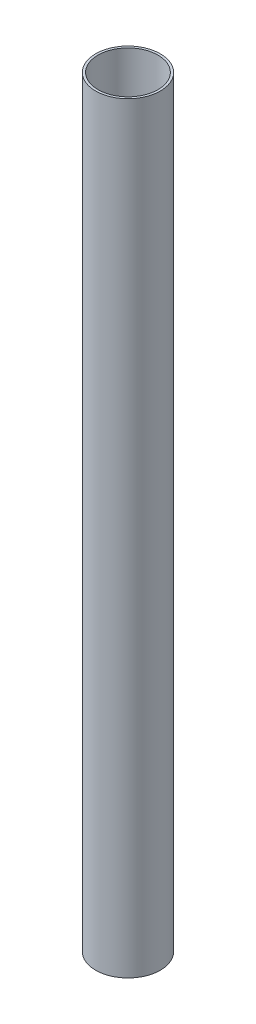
ISO-10303-21;
HEADER;
FILE_DESCRIPTION(('STEP AP214'),'2;1');
FILE_NAME('part.step','',(''),(''),'','','');
FILE_SCHEMA(('AUTOMOTIVE_DESIGN { 1 0 10303 214 1 1 1 1 }'));
ENDSEC;
DATA;
#1=APPLICATION_CONTEXT('core data for automotive mechanical design processes');
#2=APPLICATION_PROTOCOL_DEFINITION('international standard','automotive_design',2000,#1);
#3=PRODUCT_CONTEXT('',#1,'mechanical');
#4=PRODUCT('Part','Part','',(#3));
#5=PRODUCT_RELATED_PRODUCT_CATEGORY('part','',(#4));
#6=PRODUCT_DEFINITION_FORMATION('','',#4);
#7=PRODUCT_DEFINITION_CONTEXT('part definition',#1,'design');
#8=PRODUCT_DEFINITION('design','',#6,#7);
#9=PRODUCT_DEFINITION_SHAPE('','',#8);
#10=(LENGTH_UNIT() NAMED_UNIT(*) SI_UNIT(.MILLI.,.METRE.));
#11=(NAMED_UNIT(*) PLANE_ANGLE_UNIT() SI_UNIT($,.RADIAN.));
#12=(NAMED_UNIT(*) SI_UNIT($,.STERADIAN.) SOLID_ANGLE_UNIT());
#13=UNCERTAINTY_MEASURE_WITH_UNIT(LENGTH_MEASURE(1.E-05),#10,'distance_accuracy_value','');
#14=(GEOMETRIC_REPRESENTATION_CONTEXT(3) GLOBAL_UNCERTAINTY_ASSIGNED_CONTEXT((#13)) GLOBAL_UNIT_ASSIGNED_CONTEXT((#10,
#11,#12)) REPRESENTATION_CONTEXT('',''));
#15=CARTESIAN_POINT('',(0.,0.,0.));
#16=DIRECTION('',(0.,0.,1.));
#17=DIRECTION('',(1.,0.,0.));
#18=AXIS2_PLACEMENT_3D('',#15,#16,#17);
#19=CARTESIAN_POINT('',(0.,-330.,0.));
#20=DIRECTION('',(0.,1.,0.));
#21=DIRECTION('',(0.,0.,1.));
#22=AXIS2_PLACEMENT_3D('',#19,#20,#21);
#23=CYLINDRICAL_SURFACE('',#22,14.);
#24=CARTESIAN_POINT('',(0.,-330.,0.));
#25=DIRECTION('',(0.,1.,0.));
#26=DIRECTION('',(0.,0.,1.));
#27=AXIS2_PLACEMENT_3D('',#24,#25,#26);
#28=CIRCLE('',#27,14.);
#29=CARTESIAN_POINT('',(0.,-330.,14.));
#30=VERTEX_POINT('',#29);
#31=EDGE_CURVE('E10',#30,#30,#28,.T.);
#32=ORIENTED_EDGE('',*,*,#31,.T.);
#33=EDGE_LOOP('',(#32));
#34=FACE_BOUND('',#33,.T.);
#35=CARTESIAN_POINT('',(0.,0.,0.));
#36=DIRECTION('',(0.,1.,0.));
#37=DIRECTION('',(0.,0.,1.));
#38=AXIS2_PLACEMENT_3D('',#35,#36,#37);
#39=CIRCLE('',#38,14.);
#40=CARTESIAN_POINT('',(0.,0.,14.));
#41=VERTEX_POINT('',#40);
#42=EDGE_CURVE('E40',#41,#41,#39,.T.);
#43=ORIENTED_EDGE('',*,*,#42,.F.);
#44=EDGE_LOOP('',(#43));
#45=FACE_BOUND('',#44,.T.);
#46=ADVANCED_FACE('F37',(#34,#45),#23,.T.);
#47=CARTESIAN_POINT('',(0.,-330.,0.));
#48=DIRECTION('',(0.,1.,0.));
#49=DIRECTION('',(0.,0.,1.));
#50=AXIS2_PLACEMENT_3D('',#47,#48,#49);
#51=PLANE('',#50);
#52=CARTESIAN_POINT('',(0.,-330.,0.));
#53=DIRECTION('',(0.,1.,0.));
#54=DIRECTION('',(0.,0.,1.));
#55=AXIS2_PLACEMENT_3D('',#52,#53,#54);
#56=CIRCLE('',#55,13.);
#57=CARTESIAN_POINT('',(0.,-330.,13.));
#58=VERTEX_POINT('',#57);
#59=EDGE_CURVE('E47',#58,#58,#56,.T.);
#60=ORIENTED_EDGE('',*,*,#59,.T.);
#61=EDGE_LOOP('',(#60));
#62=FACE_BOUND('',#61,.T.);
#63=ORIENTED_EDGE('',*,*,#31,.F.);
#64=EDGE_LOOP('',(#63));
#65=FACE_BOUND('',#64,.T.);
#66=ADVANCED_FACE('F55',(#62,#65),#51,.F.);
#67=CARTESIAN_POINT('',(0.,0.,0.));
#68=DIRECTION('',(0.,1.,0.));
#69=DIRECTION('',(0.,0.,1.));
#70=AXIS2_PLACEMENT_3D('',#67,#68,#69);
#71=PLANE('',#70);
#72=CARTESIAN_POINT('',(0.,0.,0.));
#73=DIRECTION('',(0.,1.,0.));
#74=DIRECTION('',(0.,0.,1.));
#75=AXIS2_PLACEMENT_3D('',#72,#73,#74);
#76=CIRCLE('',#75,13.);
#77=CARTESIAN_POINT('',(0.,0.,13.));
#78=VERTEX_POINT('',#77);
#79=EDGE_CURVE('E49',#78,#78,#76,.T.);
#80=ORIENTED_EDGE('',*,*,#79,.F.);
#81=EDGE_LOOP('',(#80));
#82=FACE_BOUND('',#81,.T.);
#83=ORIENTED_EDGE('',*,*,#42,.T.);
#84=EDGE_LOOP('',(#83));
#85=FACE_BOUND('',#84,.T.);
#86=ADVANCED_FACE('F61',(#82,#85),#71,.T.);
#87=CARTESIAN_POINT('',(0.,-330.,0.));
#88=DIRECTION('',(0.,1.,0.));
#89=DIRECTION('',(0.,0.,1.));
#90=AXIS2_PLACEMENT_3D('',#87,#88,#89);
#91=CYLINDRICAL_SURFACE('',#90,13.);
#92=ORIENTED_EDGE('',*,*,#59,.F.);
#93=EDGE_LOOP('',(#92));
#94=FACE_BOUND('',#93,.T.);
#95=ORIENTED_EDGE('',*,*,#79,.T.);
#96=EDGE_LOOP('',(#95));
#97=FACE_BOUND('',#96,.T.);
#98=ADVANCED_FACE('F58',(#94,#97),#91,.F.);
#99=CLOSED_SHELL('',(#46,#66,#86,#98));
#100=MANIFOLD_SOLID_BREP('B2',#99);
#101=ADVANCED_BREP_SHAPE_REPRESENTATION('',(#18,#100),#14);
#102=SHAPE_DEFINITION_REPRESENTATION(#9,#101);
ENDSEC;
END-ISO-10303-21;
